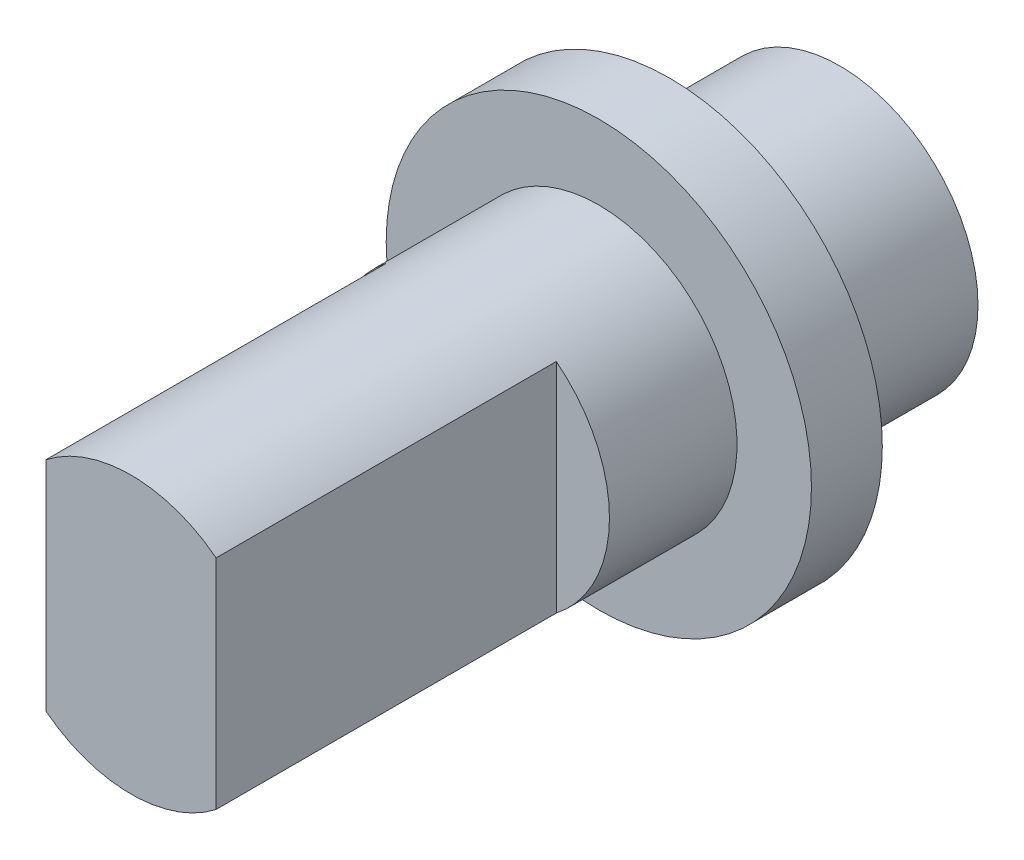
from build123d import *

# Parameters (mm, degrees)
SKETCH1_R           = 2.4765
BOSS_EXTRUDE1_DEPTH = 12.7
SKETCH2_W           = 1.490361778
SKETCH2_H           = 4.603983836
CUT_EXTRUDE1_DEPTH  = 6.096
SKETCH3_W           = 1.27
SKETCH3_H           = 3.81


with BuildPart() as part:
    # Sketch1 → Boss-Extrude1 (new body)
    with BuildSketch(Plane.XY):
        Circle(SKETCH1_R)
    extrude(amount=BOSS_EXTRUDE1_DEPTH)

    # Sketch2 → Cut-Extrude1 (cut)
    with BuildSketch(Plane.XY.offset(12.7)):
        with Locations((2.269180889, -0.161376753)):
            Rectangle(SKETCH2_W, SKETCH2_H)
        with Locations((-2.269180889, -0.161376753)):
            Rectangle(SKETCH2_W, SKETCH2_H)
    extrude(amount=-CUT_EXTRUDE1_DEPTH, mode=Mode.SUBTRACT)

    # Sketch3 → Revolve1 (revolve)
    with BuildSketch(Plane(origin=(0, 0, 0), x_dir=(0, 0, -1), z_dir=(1, 0, 0)), mode=Mode.PRIVATE) as revolve1_sk:
        with Locations((-3.683, 1.905)):
            Rectangle(SKETCH3_W, SKETCH3_H)
    revolve(revolve1_sk.sketch.rotate(Axis((0, 0, 14.278296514), (0, 0, -1)), 180), axis=Axis((0, 0, 14.278296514), (0, 0, -1)))


solid = part.part
